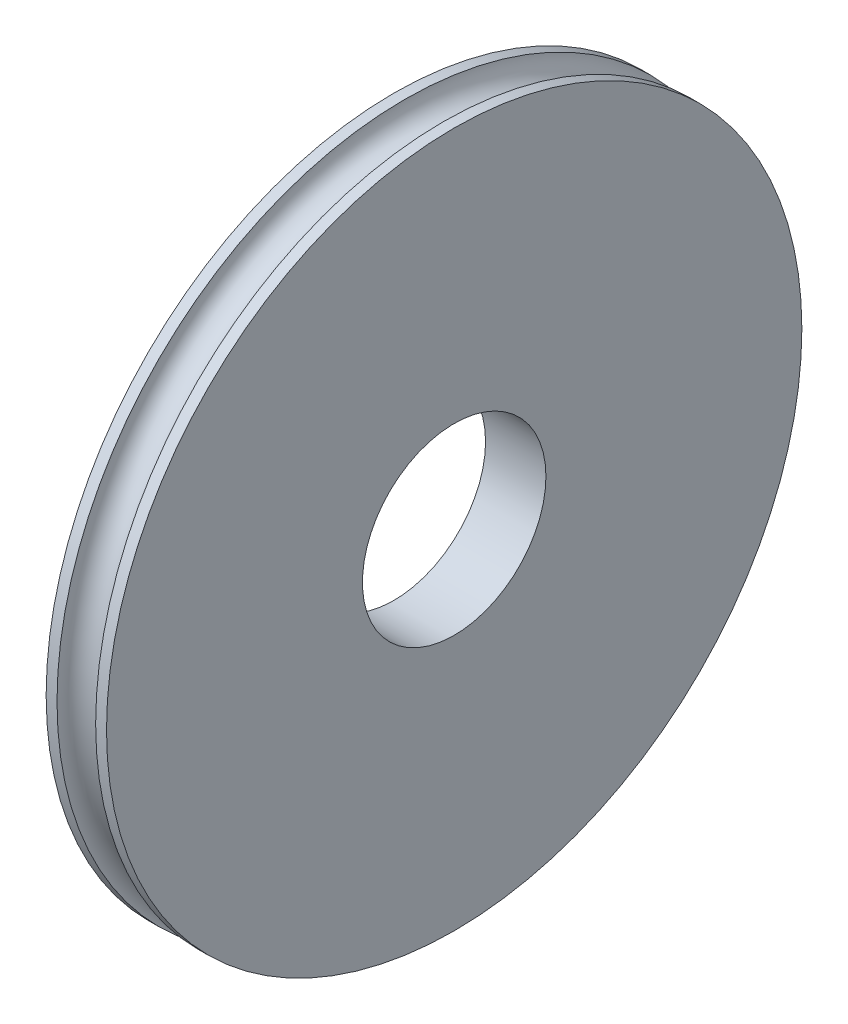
from build123d import *

# Parameters (mm, degrees)
F_19_0_19_DIAMETER_HOLE1_D = 19


with BuildPart() as part:
    # Sketch1 → Revolve1 (revolve)
    with BuildSketch(Plane.XY, mode=Mode.PRIVATE) as revolve1_sk:
        with BuildLine():
            Line((-3.125, 0), (3.125, 0))
            Line((3.125, 0), (3.125, 36))
            Line((3.125, 36), (2, 36))
            ThreePointArc((2, 36), (0, 34), (-2, 36))
            Line((-2, 36), (-3.125, 36))
            Line((-3.125, 36), (-3.125, 0))
        make_face()
    revolve(revolve1_sk.sketch.rotate(Axis((-22.996218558, 0, 0), (1, 0, 0)), 180), axis=Axis((-22.996218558, 0, 0), (1, 0, 0)))

    # 19.0 _19_ Diameter Hole1 (through all)
    with Locations(Plane(origin=(3.125, 0, 0), x_dir=(0, 0, -1), z_dir=(1, 0, 0))):
        with Locations((0, 0)):
            Hole(F_19_0_19_DIAMETER_HOLE1_D / 2)


solid = part.part
